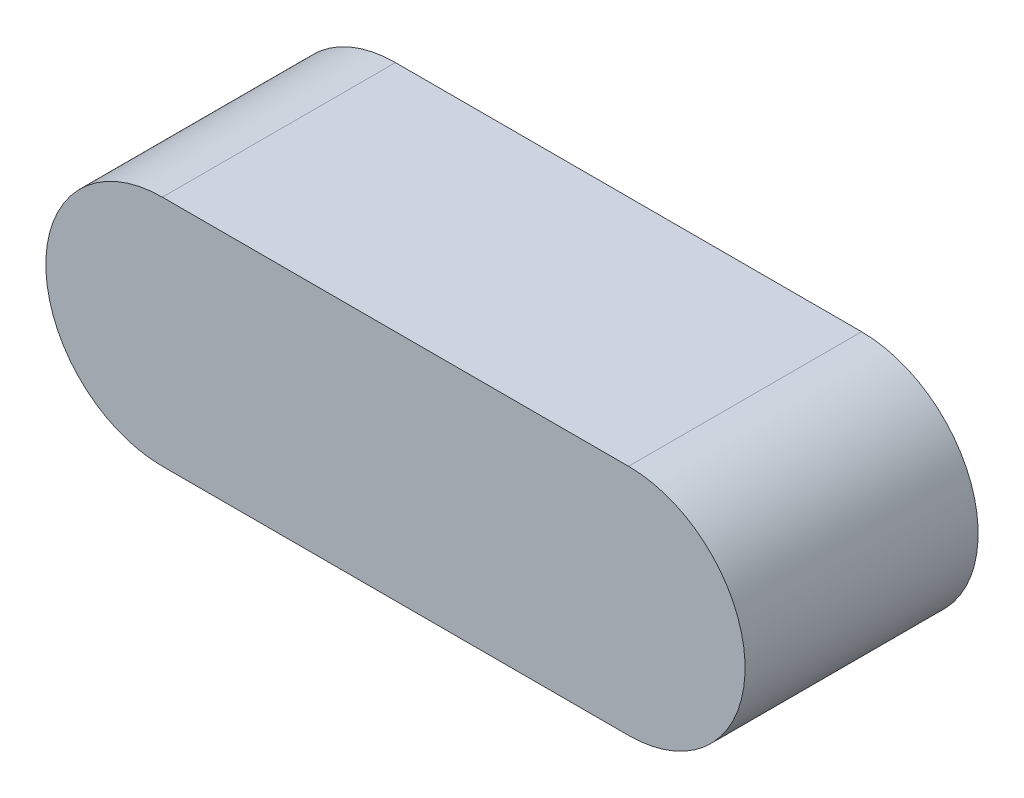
from build123d import *

# Parameters (mm, degrees)
EXTRUDE_1_DEPTH = 4


with BuildPart() as part:
    # Sketch 1 → Extrude 1 (new body)
    with BuildSketch(Plane.XY):
        with BuildLine():
            Line((-71.110745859, 2), (-63.110745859, 2))
            ThreePointArc((-63.110745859, 2), (-61.110745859, 0), (-63.110745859, -2))
            Line((-63.110745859, -2), (-71.110745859, -2))
            ThreePointArc((-71.110745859, -2), (-73.110745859, 0), (-71.110745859, 2))
        make_face()
    extrude(amount=EXTRUDE_1_DEPTH)


solid = part.part
